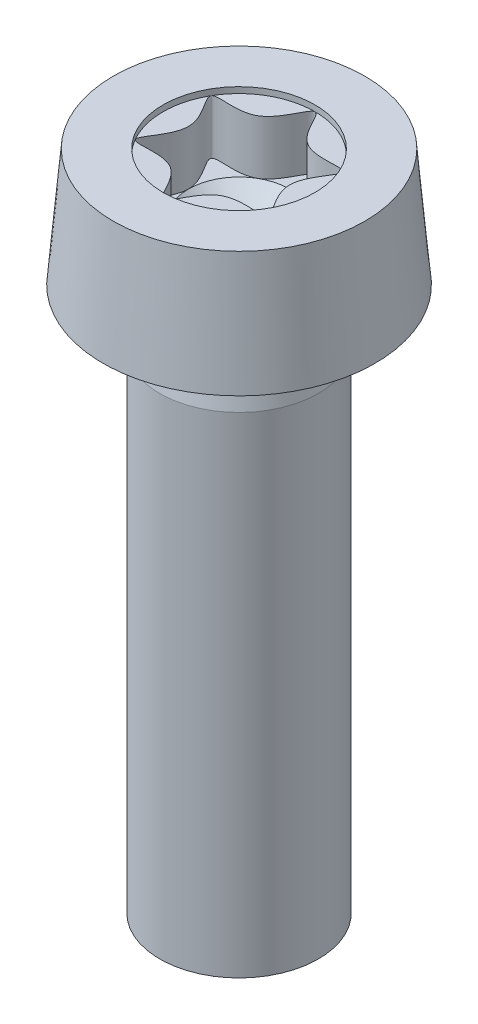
ISO-10303-21;
HEADER;
FILE_DESCRIPTION(('STEP AP214'),'2;1');
FILE_NAME('part.step','',(''),(''),'','','');
FILE_SCHEMA(('AUTOMOTIVE_DESIGN { 1 0 10303 214 1 1 1 1 }'));
ENDSEC;
DATA;
#1=APPLICATION_CONTEXT('core data for automotive mechanical design processes');
#2=APPLICATION_PROTOCOL_DEFINITION('international standard','automotive_design',2000,#1);
#3=PRODUCT_CONTEXT('',#1,'mechanical');
#4=PRODUCT('Part','Part','',(#3));
#5=PRODUCT_RELATED_PRODUCT_CATEGORY('part','',(#4));
#6=PRODUCT_DEFINITION_FORMATION('','',#4);
#7=PRODUCT_DEFINITION_CONTEXT('part definition',#1,'design');
#8=PRODUCT_DEFINITION('design','',#6,#7);
#9=PRODUCT_DEFINITION_SHAPE('','',#8);
#10=(LENGTH_UNIT() NAMED_UNIT(*) SI_UNIT(.MILLI.,.METRE.));
#11=(NAMED_UNIT(*) PLANE_ANGLE_UNIT() SI_UNIT($,.RADIAN.));
#12=(NAMED_UNIT(*) SI_UNIT($,.STERADIAN.) SOLID_ANGLE_UNIT());
#13=UNCERTAINTY_MEASURE_WITH_UNIT(LENGTH_MEASURE(1.E-05),#10,'distance_accuracy_value','');
#14=(GEOMETRIC_REPRESENTATION_CONTEXT(3) GLOBAL_UNCERTAINTY_ASSIGNED_CONTEXT((#13)) GLOBAL_UNIT_ASSIGNED_CONTEXT((#10,
#11,#12)) REPRESENTATION_CONTEXT('',''));
#15=CARTESIAN_POINT('',(0.,0.,0.));
#16=DIRECTION('',(0.,0.,1.));
#17=DIRECTION('',(1.,0.,0.));
#18=AXIS2_PLACEMENT_3D('',#15,#16,#17);
#19=CARTESIAN_POINT('',(0.,13.27,1.675));
#20=DIRECTION('',(0.,1.,0.));
#21=DIRECTION('',(0.,0.,1.));
#22=AXIS2_PLACEMENT_3D('',#19,#20,#21);
#23=PLANE('',#22);
#24=CARTESIAN_POINT('',(0.,13.27,-1.675));
#25=CARTESIAN_POINT('',(0.120421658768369,13.27,-1.675));
#26=CARTESIAN_POINT('',(0.361264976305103,13.27,-0.625729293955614));
#27=CARTESIAN_POINT('',(1.90494009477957,13.27,-1.0998176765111));
#28=CARTESIAN_POINT('',(0.722529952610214,13.27,0.));
#29=CARTESIAN_POINT('',(1.90494009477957,13.27,1.09981767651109));
#30=CARTESIAN_POINT('',(0.361264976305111,13.27,0.625729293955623));
#31=CARTESIAN_POINT('',(0.,13.27,2.19963535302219));
#32=CARTESIAN_POINT('',(-0.361264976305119,13.27,0.625729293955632));
#33=CARTESIAN_POINT('',(-1.90494009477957,13.27,1.09981767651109));
#34=CARTESIAN_POINT('',(-0.722529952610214,13.27,0.));
#35=CARTESIAN_POINT('',(-1.90494009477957,13.27,-1.09981767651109));
#36=CARTESIAN_POINT('',(-0.361264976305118,13.27,-0.62572929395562));
#37=CARTESIAN_POINT('',(-0.120421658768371,13.27,-1.675));
#38=CARTESIAN_POINT('',(0.,13.27,-1.675));
#39=B_SPLINE_CURVE_WITH_KNOTS('',3,(#24,#25,#26,#27,#28,#29,#30,#31,#32,#33,#34,#35,#36,#37,
#38),.UNSPECIFIED.,.T.,.F.,(4,1,1,1,1,1,1,1,1,1,1,1,4),(0.,0.0833333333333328,0.166666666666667,
0.25,0.333333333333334,0.416666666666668,0.5,0.583333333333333,0.666666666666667,0.75,
0.833333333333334,0.916666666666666,1.),.UNSPECIFIED.);
#40=CARTESIAN_POINT('',(0.55833333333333,13.27,-0.967061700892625));
#41=VERTEX_POINT('',#40);
#42=CARTESIAN_POINT('',(1.1166666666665,13.27,0.));
#43=VERTEX_POINT('',#42);
#44=EDGE_CURVE('E141',#41,#43,#39,.T.);
#45=ORIENTED_EDGE('',*,*,#44,.F.);
#46=CARTESIAN_POINT('',(0.,13.27,0.));
#47=DIRECTION('',(0.,-1.,0.));
#48=DIRECTION('',(0.,0.,-1.));
#49=AXIS2_PLACEMENT_3D('',#46,#47,#48);
#50=CIRCLE('',#49,1.1166666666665);
#51=EDGE_CURVE('E52',#41,#43,#50,.T.);
#52=ORIENTED_EDGE('',*,*,#51,.T.);
#53=EDGE_LOOP('',(#45,#52));
#54=FACE_BOUND('',#53,.T.);
#55=ADVANCED_FACE('F39',(#54),#23,.T.);
#56=CARTESIAN_POINT('',(0.558333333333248,13.27,0.96706170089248));
#57=VERTEX_POINT('',#56);
#58=EDGE_CURVE('E156',#43,#57,#39,.T.);
#59=ORIENTED_EDGE('',*,*,#58,.F.);
#60=EDGE_CURVE('E11',#43,#57,#50,.T.);
#61=ORIENTED_EDGE('',*,*,#60,.T.);
#62=EDGE_LOOP('',(#59,#61));
#63=FACE_BOUND('',#62,.T.);
#64=ADVANCED_FACE('F109',(#63),#23,.T.);
#65=CARTESIAN_POINT('',(-0.55833333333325,13.27,0.967061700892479));
#66=VERTEX_POINT('',#65);
#67=EDGE_CURVE('E149',#57,#66,#39,.T.);
#68=ORIENTED_EDGE('',*,*,#67,.F.);
#69=EDGE_CURVE('E50',#57,#66,#50,.T.);
#70=ORIENTED_EDGE('',*,*,#69,.T.);
#71=EDGE_LOOP('',(#68,#70));
#72=FACE_BOUND('',#71,.T.);
#73=ADVANCED_FACE('F116',(#72),#23,.T.);
#74=CARTESIAN_POINT('',(-1.1166666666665,13.27,0.));
#75=VERTEX_POINT('',#74);
#76=EDGE_CURVE('E147',#66,#75,#39,.T.);
#77=ORIENTED_EDGE('',*,*,#76,.F.);
#78=EDGE_CURVE('E434',#66,#75,#50,.T.);
#79=ORIENTED_EDGE('',*,*,#78,.T.);
#80=EDGE_LOOP('',(#77,#79));
#81=FACE_BOUND('',#80,.T.);
#82=ADVANCED_FACE('F130',(#81),#23,.T.);
#83=CARTESIAN_POINT('',(-0.558333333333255,13.27,-0.967061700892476));
#84=VERTEX_POINT('',#83);
#85=EDGE_CURVE('E138',#75,#84,#39,.T.);
#86=ORIENTED_EDGE('',*,*,#85,.F.);
#87=EDGE_CURVE('E211',#75,#84,#50,.T.);
#88=ORIENTED_EDGE('',*,*,#87,.T.);
#89=EDGE_LOOP('',(#86,#88));
#90=FACE_BOUND('',#89,.T.);
#91=ADVANCED_FACE('F122',(#90),#23,.T.);
#92=EDGE_CURVE('E134',#84,#41,#39,.T.);
#93=ORIENTED_EDGE('',*,*,#92,.F.);
#94=EDGE_CURVE('E136',#84,#41,#50,.T.);
#95=ORIENTED_EDGE('',*,*,#94,.T.);
#96=EDGE_LOOP('',(#93,#95));
#97=FACE_BOUND('',#96,.T.);
#98=ADVANCED_FACE('F112',(#97),#23,.T.);
#99=CARTESIAN_POINT('',(0.,14.6,0.));
#100=DIRECTION('',(0.,1.,0.));
#101=DIRECTION('',(0.,0.,1.));
#102=AXIS2_PLACEMENT_3D('',#99,#100,#101);
#103=PLANE('',#102);
#104=CARTESIAN_POINT('',(0.,14.6,0.));
#105=DIRECTION('',(0.,1.,0.));
#106=DIRECTION('',(0.,0.,1.));
#107=AXIS2_PLACEMENT_3D('',#104,#105,#106);
#108=CIRCLE('',#107,1.675);
#109=CARTESIAN_POINT('',(0.,14.6,1.675));
#110=VERTEX_POINT('',#109);
#111=EDGE_CURVE('E157',#110,#110,#108,.T.);
#112=ORIENTED_EDGE('',*,*,#111,.F.);
#113=EDGE_LOOP('',(#112));
#114=FACE_BOUND('',#113,.T.);
#115=CARTESIAN_POINT('',(0.,14.6,0.));
#116=DIRECTION('',(0.,-1.,0.));
#117=DIRECTION('',(0.,0.,-1.));
#118=AXIS2_PLACEMENT_3D('',#115,#116,#117);
#119=CIRCLE('',#118,2.77252947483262);
#120=CARTESIAN_POINT('',(0.,14.6,-2.77252947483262));
#121=VERTEX_POINT('',#120);
#122=EDGE_CURVE('E187',#121,#121,#119,.T.);
#123=ORIENTED_EDGE('',*,*,#122,.F.);
#124=EDGE_LOOP('',(#123));
#125=FACE_BOUND('',#124,.T.);
#126=ADVANCED_FACE('F121',(#114,#125),#103,.T.);
#127=CARTESIAN_POINT('',(0.,12.,0.));
#128=DIRECTION('',(0.,-1.,0.));
#129=DIRECTION('',(0.,0.,-1.));
#130=AXIS2_PLACEMENT_3D('',#127,#128,#129);
#131=CONICAL_SURFACE('',#130,3.,0.0872664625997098);
#132=ORIENTED_EDGE('',*,*,#122,.T.);
#133=EDGE_LOOP('',(#132));
#134=FACE_BOUND('',#133,.T.);
#135=CARTESIAN_POINT('',(0.,12.,0.));
#136=DIRECTION('',(0.,-1.,0.));
#137=DIRECTION('',(0.,0.,-1.));
#138=AXIS2_PLACEMENT_3D('',#135,#136,#137);
#139=CIRCLE('',#138,3.);
#140=CARTESIAN_POINT('',(0.,12.,-3.));
#141=VERTEX_POINT('',#140);
#142=EDGE_CURVE('E190',#141,#141,#139,.T.);
#143=ORIENTED_EDGE('',*,*,#142,.F.);
#144=EDGE_LOOP('',(#143));
#145=FACE_BOUND('',#144,.T.);
#146=ADVANCED_FACE('F128',(#134,#145),#131,.T.);
#147=CARTESIAN_POINT('',(1.51,12.,0.));
#148=DIRECTION('',(0.,-1.,0.));
#149=DIRECTION('',(0.,0.,-1.));
#150=AXIS2_PLACEMENT_3D('',#147,#148,#149);
#151=PLANE('',#150);
#152=CARTESIAN_POINT('',(0.,12.,0.));
#153=DIRECTION('',(0.,-1.,0.));
#154=DIRECTION('',(0.,0.,-1.));
#155=AXIS2_PLACEMENT_3D('',#152,#153,#154);
#156=CIRCLE('',#155,1.63198039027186);
#157=CARTESIAN_POINT('',(0.,12.,-1.63198039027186));
#158=VERTEX_POINT('',#157);
#159=EDGE_CURVE('E199',#158,#158,#156,.F.);
#160=ORIENTED_EDGE('',*,*,#159,.T.);
#161=EDGE_LOOP('',(#160));
#162=FACE_BOUND('',#161,.T.);
#163=ORIENTED_EDGE('',*,*,#142,.T.);
#164=EDGE_LOOP('',(#163));
#165=FACE_BOUND('',#164,.T.);
#166=ADVANCED_FACE('F175',(#162,#165),#151,.T.);
#167=CARTESIAN_POINT('',(0.,10.8,0.));
#168=DIRECTION('',(0.,-1.,0.));
#169=DIRECTION('',(0.,0.,-1.));
#170=AXIS2_PLACEMENT_3D('',#167,#168,#169);
#171=CONICAL_SURFACE('',#170,1.75,0.197395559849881);
#172=CARTESIAN_POINT('',(0.,11.8803883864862,0.));
#173=DIRECTION('',(0.,-1.,0.));
#174=DIRECTION('',(0.,0.,-1.));
#175=AXIS2_PLACEMENT_3D('',#172,#173,#174);
#176=CIRCLE('',#175,1.53392232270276);
#177=CARTESIAN_POINT('',(0.,11.8803883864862,-1.53392232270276));
#178=VERTEX_POINT('',#177);
#179=EDGE_CURVE('E194',#178,#178,#176,.T.);
#180=ORIENTED_EDGE('',*,*,#179,.T.);
#181=EDGE_LOOP('',(#180));
#182=FACE_BOUND('',#181,.T.);
#183=CARTESIAN_POINT('',(0.,10.8,0.));
#184=DIRECTION('',(0.,-1.,0.));
#185=DIRECTION('',(0.,0.,-1.));
#186=AXIS2_PLACEMENT_3D('',#183,#184,#185);
#187=CIRCLE('',#186,1.75);
#188=CARTESIAN_POINT('',(0.,10.8,-1.75));
#189=VERTEX_POINT('',#188);
#190=EDGE_CURVE('E192',#189,#189,#187,.T.);
#191=ORIENTED_EDGE('',*,*,#190,.F.);
#192=EDGE_LOOP('',(#191));
#193=FACE_BOUND('',#192,.T.);
#194=ADVANCED_FACE('F171',(#182,#193),#171,.T.);
#195=CARTESIAN_POINT('',(0.,0.,0.));
#196=DIRECTION('',(0.,-1.,0.));
#197=DIRECTION('',(0.,0.,-1.));
#198=AXIS2_PLACEMENT_3D('',#195,#196,#197);
#199=CYLINDRICAL_SURFACE('',#198,1.75);
#200=ORIENTED_EDGE('',*,*,#190,.T.);
#201=EDGE_LOOP('',(#200));
#202=FACE_BOUND('',#201,.T.);
#203=CARTESIAN_POINT('',(0.,0.,0.));
#204=DIRECTION('',(0.,-1.,0.));
#205=DIRECTION('',(0.,0.,-1.));
#206=AXIS2_PLACEMENT_3D('',#203,#204,#205);
#207=CIRCLE('',#206,1.75);
#208=CARTESIAN_POINT('',(0.,0.,-1.75));
#209=VERTEX_POINT('',#208);
#210=EDGE_CURVE('E155',#209,#209,#207,.T.);
#211=ORIENTED_EDGE('',*,*,#210,.F.);
#212=EDGE_LOOP('',(#211));
#213=FACE_BOUND('',#212,.T.);
#214=ADVANCED_FACE('F167',(#202,#213),#199,.T.);
#215=CARTESIAN_POINT('',(1.75,0.,0.));
#216=DIRECTION('',(0.,-1.,0.));
#217=DIRECTION('',(0.,0.,-1.));
#218=AXIS2_PLACEMENT_3D('',#215,#216,#217);
#219=PLANE('',#218);
#220=ORIENTED_EDGE('',*,*,#210,.T.);
#221=EDGE_LOOP('',(#220));
#222=FACE_BOUND('',#221,.T.);
#223=ADVANCED_FACE('F164',(#222),#219,.T.);
#224=CARTESIAN_POINT('',(0.,11.9,0.));
#225=DIRECTION('',(0.,-1.,0.));
#226=DIRECTION('',(0.,0.,-1.));
#227=AXIS2_PLACEMENT_3D('',#224,#225,#226);
#228=TOROIDAL_SURFACE('',#227,1.63198039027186,0.1);
#229=ORIENTED_EDGE('',*,*,#159,.F.);
#230=EDGE_LOOP('',(#229));
#231=FACE_BOUND('',#230,.T.);
#232=ORIENTED_EDGE('',*,*,#179,.F.);
#233=EDGE_LOOP('',(#232));
#234=FACE_BOUND('',#233,.T.);
#235=ADVANCED_FACE('F41',(#231,#234),#228,.F.);
#236=CARTESIAN_POINT('',(0.,14.467,0.));
#237=DIRECTION('',(0.,1.,0.));
#238=DIRECTION('',(0.,0.,1.));
#239=AXIS2_PLACEMENT_3D('',#236,#237,#238);
#240=CYLINDRICAL_SURFACE('',#239,1.675);
#241=ORIENTED_EDGE('',*,*,#111,.T.);
#242=EDGE_LOOP('',(#241));
#243=FACE_BOUND('',#242,.T.);
#244=CARTESIAN_POINT('',(0.,14.467,0.));
#245=DIRECTION('',(0.,1.,0.));
#246=DIRECTION('',(0.,0.,1.));
#247=AXIS2_PLACEMENT_3D('',#244,#245,#246);
#248=CIRCLE('',#247,1.675);
#249=CARTESIAN_POINT('',(1.45059255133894,14.467,0.8375));
#250=VERTEX_POINT('',#249);
#251=CARTESIAN_POINT('',(1.45059255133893,14.467,-0.837500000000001));
#252=VERTEX_POINT('',#251);
#253=EDGE_CURVE('E231',#250,#252,#248,.T.);
#254=ORIENTED_EDGE('',*,*,#253,.F.);
#255=CARTESIAN_POINT('',(0.,14.467,1.675));
#256=VERTEX_POINT('',#255);
#257=EDGE_CURVE('E139',#256,#250,#248,.T.);
#258=ORIENTED_EDGE('',*,*,#257,.F.);
#259=CARTESIAN_POINT('',(-1.45059255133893,14.467,0.837500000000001));
#260=VERTEX_POINT('',#259);
#261=EDGE_CURVE('E222',#260,#256,#248,.T.);
#262=ORIENTED_EDGE('',*,*,#261,.F.);
#263=CARTESIAN_POINT('',(-1.45059255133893,14.467,-0.8375));
#264=VERTEX_POINT('',#263);
#265=EDGE_CURVE('E227',#264,#260,#248,.T.);
#266=ORIENTED_EDGE('',*,*,#265,.F.);
#267=CARTESIAN_POINT('',(0.,14.467,-1.675));
#268=VERTEX_POINT('',#267);
#269=EDGE_CURVE('E265',#268,#264,#248,.T.);
#270=ORIENTED_EDGE('',*,*,#269,.F.);
#271=EDGE_CURVE('E65',#252,#268,#248,.T.);
#272=ORIENTED_EDGE('',*,*,#271,.F.);
#273=EDGE_LOOP('',(#254,#258,#262,#266,#270,#272));
#274=FACE_BOUND('',#273,.T.);
#275=ADVANCED_FACE('F229',(#243,#274),#240,.F.);
#276=CARTESIAN_POINT('',(0.,14.467,0.));
#277=DIRECTION('',(0.,1.,0.));
#278=DIRECTION('',(0.,0.,1.));
#279=AXIS2_PLACEMENT_3D('',#276,#277,#278);
#280=PLANE('',#279);
#281=ORIENTED_EDGE('',*,*,#269,.T.);
#282=CARTESIAN_POINT('',(0.,14.467,-1.675));
#283=CARTESIAN_POINT('',(0.120421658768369,14.467,-1.675));
#284=CARTESIAN_POINT('',(0.361264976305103,14.467,-0.625729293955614));
#285=CARTESIAN_POINT('',(1.90494009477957,14.467,-1.0998176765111));
#286=CARTESIAN_POINT('',(0.722529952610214,14.467,0.));
#287=CARTESIAN_POINT('',(1.90494009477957,14.467,1.09981767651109));
#288=CARTESIAN_POINT('',(0.361264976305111,14.467,0.625729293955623));
#289=CARTESIAN_POINT('',(0.,14.467,2.19963535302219));
#290=CARTESIAN_POINT('',(-0.361264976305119,14.467,0.625729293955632));
#291=CARTESIAN_POINT('',(-1.90494009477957,14.467,1.09981767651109));
#292=CARTESIAN_POINT('',(-0.722529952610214,14.467,0.));
#293=CARTESIAN_POINT('',(-1.90494009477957,14.467,-1.09981767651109));
#294=CARTESIAN_POINT('',(-0.361264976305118,14.467,-0.62572929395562));
#295=CARTESIAN_POINT('',(-0.120421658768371,14.467,-1.675));
#296=CARTESIAN_POINT('',(0.,14.467,-1.675));
#297=B_SPLINE_CURVE_WITH_KNOTS('',3,(#282,#283,#284,#285,#286,#287,#288,#289,#290,#291,#292,
#293,#294,#295,#296),.UNSPECIFIED.,.T.,.F.,(4,1,1,1,1,1,1,1,1,1,1,1,4),(0.,0.0833333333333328,
0.166666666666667,0.25,0.333333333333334,0.416666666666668,0.5,0.583333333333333,
0.666666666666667,0.75,0.833333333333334,0.916666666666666,1.),.UNSPECIFIED.);
#298=EDGE_CURVE('E204',#268,#264,#297,.F.);
#299=ORIENTED_EDGE('',*,*,#298,.F.);
#300=EDGE_LOOP('',(#281,#299));
#301=FACE_BOUND('',#300,.T.);
#302=ADVANCED_FACE('F238',(#301),#280,.T.);
#303=ORIENTED_EDGE('',*,*,#265,.T.);
#304=EDGE_CURVE('E208',#264,#260,#297,.F.);
#305=ORIENTED_EDGE('',*,*,#304,.F.);
#306=EDGE_LOOP('',(#303,#305));
#307=FACE_BOUND('',#306,.T.);
#308=ADVANCED_FACE('F243',(#307),#280,.T.);
#309=ORIENTED_EDGE('',*,*,#261,.T.);
#310=EDGE_CURVE('E212',#260,#256,#297,.F.);
#311=ORIENTED_EDGE('',*,*,#310,.F.);
#312=EDGE_LOOP('',(#309,#311));
#313=FACE_BOUND('',#312,.T.);
#314=ADVANCED_FACE('F223',(#313),#280,.T.);
#315=ORIENTED_EDGE('',*,*,#257,.T.);
#316=EDGE_CURVE('E207',#256,#250,#297,.F.);
#317=ORIENTED_EDGE('',*,*,#316,.F.);
#318=EDGE_LOOP('',(#315,#317));
#319=FACE_BOUND('',#318,.T.);
#320=ADVANCED_FACE('F218',(#319),#280,.T.);
#321=ORIENTED_EDGE('',*,*,#253,.T.);
#322=EDGE_CURVE('E203',#250,#252,#297,.F.);
#323=ORIENTED_EDGE('',*,*,#322,.F.);
#324=EDGE_LOOP('',(#321,#323));
#325=FACE_BOUND('',#324,.T.);
#326=ADVANCED_FACE('F247',(#325),#280,.T.);
#327=ORIENTED_EDGE('',*,*,#271,.T.);
#328=EDGE_CURVE('E43',#252,#268,#297,.F.);
#329=ORIENTED_EDGE('',*,*,#328,.F.);
#330=EDGE_LOOP('',(#327,#329));
#331=FACE_BOUND('',#330,.T.);
#332=ADVANCED_FACE('F104',(#331),#280,.T.);
#333=DIRECTION('',(0.,1.,0.));
#334=VECTOR('',#333,1.);
#335=SURFACE_OF_LINEAR_EXTRUSION('',#39,#334);
#336=ORIENTED_EDGE('',*,*,#44,.T.);
#337=ORIENTED_EDGE('',*,*,#58,.T.);
#338=ORIENTED_EDGE('',*,*,#67,.T.);
#339=ORIENTED_EDGE('',*,*,#76,.T.);
#340=ORIENTED_EDGE('',*,*,#85,.T.);
#341=ORIENTED_EDGE('',*,*,#92,.T.);
#342=EDGE_LOOP('',(#336,#337,#338,#339,#340,#341));
#343=FACE_BOUND('',#342,.T.);
#344=ORIENTED_EDGE('',*,*,#328,.T.);
#345=ORIENTED_EDGE('',*,*,#298,.T.);
#346=ORIENTED_EDGE('',*,*,#304,.T.);
#347=ORIENTED_EDGE('',*,*,#310,.T.);
#348=ORIENTED_EDGE('',*,*,#316,.T.);
#349=ORIENTED_EDGE('',*,*,#322,.T.);
#350=EDGE_LOOP('',(#344,#345,#346,#347,#348,#349));
#351=FACE_BOUND('',#350,.T.);
#352=ADVANCED_FACE('F99',(#343,#351),#335,.T.);
#353=CARTESIAN_POINT('',(0.,12.26,0.));
#354=DIRECTION('',(0.,1.,0.));
#355=DIRECTION('',(0.,0.,1.));
#356=AXIS2_PLACEMENT_3D('',#353,#354,#355);
#357=CONICAL_SURFACE('',#356,0.,0.835512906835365);
#358=ORIENTED_EDGE('',*,*,#51,.F.);
#359=ORIENTED_EDGE('',*,*,#94,.F.);
#360=ORIENTED_EDGE('',*,*,#87,.F.);
#361=ORIENTED_EDGE('',*,*,#78,.F.);
#362=ORIENTED_EDGE('',*,*,#69,.F.);
#363=ORIENTED_EDGE('',*,*,#60,.F.);
#364=EDGE_LOOP('',(#358,#359,#360,#361,#362,#363));
#365=FACE_BOUND('',#364,.T.);
#366=CARTESIAN_POINT('',(0.,12.26,0.));
#367=VERTEX_POINT('',#366);
#368=VERTEX_LOOP('',#367);
#369=FACE_BOUND('',#368,.T.);
#370=ADVANCED_FACE('F97',(#365,#369),#357,.F.);
#371=CLOSED_SHELL('',(#55,#64,#73,#82,#91,#98,#126,#146,#166,#194,#214,#223,#235,#275,#302,#308,
#314,#320,#326,#332,#352,#370));
#372=MANIFOLD_SOLID_BREP('B2',#371);
#373=ADVANCED_BREP_SHAPE_REPRESENTATION('',(#18,#372),#14);
#374=SHAPE_DEFINITION_REPRESENTATION(#9,#373);
ENDSEC;
END-ISO-10303-21;
